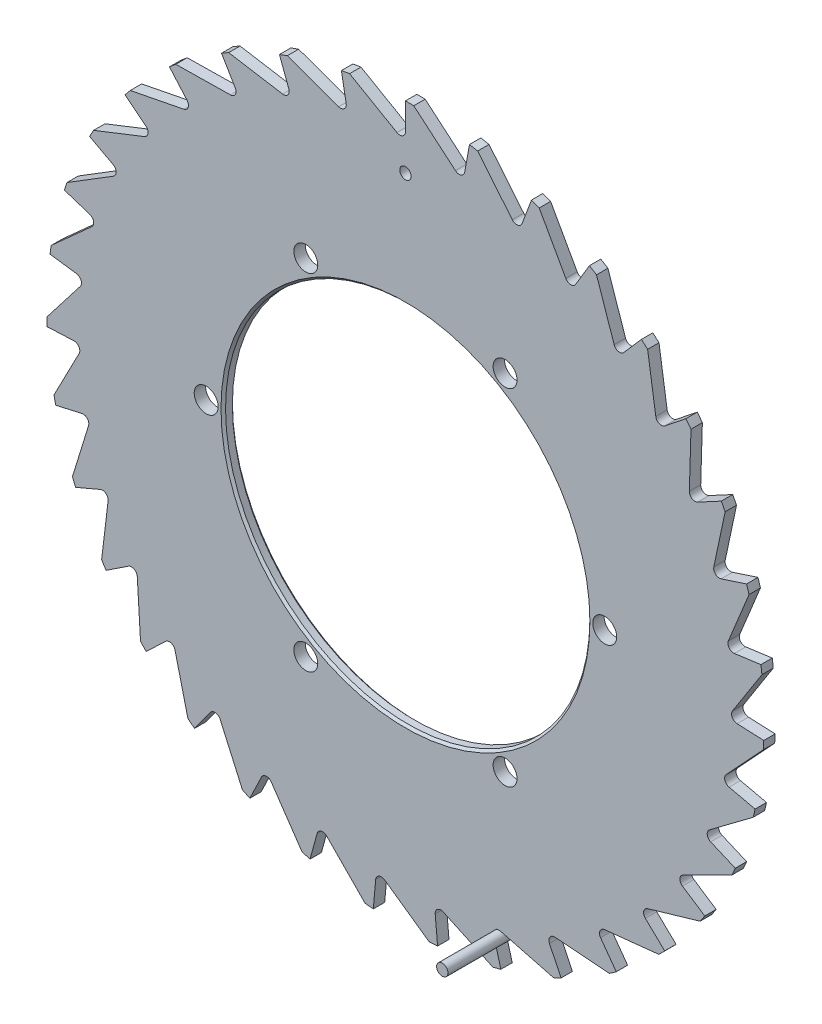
from build123d import *

# Parameters (mm, degrees)
ESQUISSE1_R                      = 31.5
ESQUISSE1_R_2                    = 16
EXTRUSION1_DEPTH                 = 1
CHANFREIN1_SIZE                  = 0.2
ENL_V_MAT_EXTRU_1_DEPTH          = 45.558949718
R_P_TITION_CIRCULAIRE1_COUNT     = 35
DIAM_TRE_DU_PER_AGE_M2_1_2_1_1_D = 2.1
R_P_TITION_CIRCULAIRE2_COUNT     = 6
ESQUISSE10_R                     = 0.5
ENL_V_MAT_EXTRU_2_DEPTH          = 45.553704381
COMPOSANTD1MM_DEPTH              = 5
COMPOSANTD1MM_DEPTH_BACK         = 20
ESQUISSE14_R                     = 0.5
ENL_V_MAT_EXTRU_6_DEPTH          = 1


with BuildPart() as part:
    # Esquisse1 → Extrusion1 (new body)
    with BuildSketch(Plane.XY):
        Circle(ESQUISSE1_R)
        Circle(ESQUISSE1_R_2, mode=Mode.SUBTRACT)
    extrude(amount=EXTRUSION1_DEPTH)

    # Chanfrein1
    chanfrein1_edges = [part.edges().sort_by_distance(p)[0] for p in [
        (-16, 0, 0),
        (-16, 0, 1),
    ]]
    chamfer(chanfrein1_edges, length=CHANFREIN1_SIZE)

    # Esquisse4 → Enl_v. mat.-Extru.1 (cut, through all)
    with BuildSketch(Plane.XY.offset(1)):
        with BuildLine():
            Line((0, 36.229056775), (0, 29.15))
            ThreePointArc((0, 29.15), (-0.25, 28.716987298), (-0.75, 28.716987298))
            Line((-0.75, 28.716987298), (-13.761286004, 36.229056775))
            Line((-13.761286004, 36.229056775), (0, 36.229056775))
        make_face()
    enl_v_mat_extru_1 = extrude(amount=-ENL_V_MAT_EXTRU_1_DEPTH, mode=Mode.SUBTRACT)

    # R_p_tition circulaire1: Enl_v. mat.-Extru.1 ×35 about axis
    r_p_tition_circulaire1_axis = Axis((0, 0, 0), (0, 0, 1))
    for i in range(1, R_P_TITION_CIRCULAIRE1_COUNT):
        add(enl_v_mat_extru_1.rotate(r_p_tition_circulaire1_axis, i * 360 / R_P_TITION_CIRCULAIRE1_COUNT), mode=Mode.SUBTRACT)

    # Diam_tre du per_age M2.1 _2.1_1 (through all)
    with Locations(Plane.XY.offset(1)):
        with Locations((-17.5, 0)):
            diam_tre_du_per_age_m2_1_2_1_1 = Hole(DIAM_TRE_DU_PER_AGE_M2_1_2_1_1_D / 2)

    # R_p_tition circulaire2: Diam_tre du per_age M2.1 _2.1_1 ×6 about axis
    r_p_tition_circulaire2_axis = Axis((0, 0, 0), (0, 0, 1))
    for i in range(1, R_P_TITION_CIRCULAIRE2_COUNT):
        add(diam_tre_du_per_age_m2_1_2_1_1.rotate(r_p_tition_circulaire2_axis, i * 360 / R_P_TITION_CIRCULAIRE2_COUNT), mode=Mode.SUBTRACT)

    # Esquisse10 → Enl_v. mat.-Extru.2 (cut, through all)
    with BuildSketch(Plane.XY.offset(1)):
        with Locations((0, 26)):
            Circle(ESQUISSE10_R)
    extrude(amount=-ENL_V_MAT_EXTRU_2_DEPTH, mode=Mode.SUBTRACT)

    # Esquisse14 → composantD1mm (add, two sides: drawn at the far end of the back side and taken through both)
    with BuildSketch(Plane.XY.offset(1).offset(-COMPOSANTD1MM_DEPTH_BACK)):
        with Locations((8.236955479, -27.966498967)):
            Circle(ESQUISSE14_R)
    extrude(amount=COMPOSANTD1MM_DEPTH + COMPOSANTD1MM_DEPTH_BACK)

    # Esquisse17 → Enl_v. mat.-Extru.6 (cut)
    with BuildSketch(Plane.XY.offset(1)):
        Polygon((8.584991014, -28.325485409), (8.523059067, -28.417770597), (7.979913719, -27.486869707), (8.095690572, -27.486869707), align=None)
    extrude(amount=-ENL_V_MAT_EXTRU_6_DEPTH, mode=Mode.SUBTRACT)


solid = part.part
